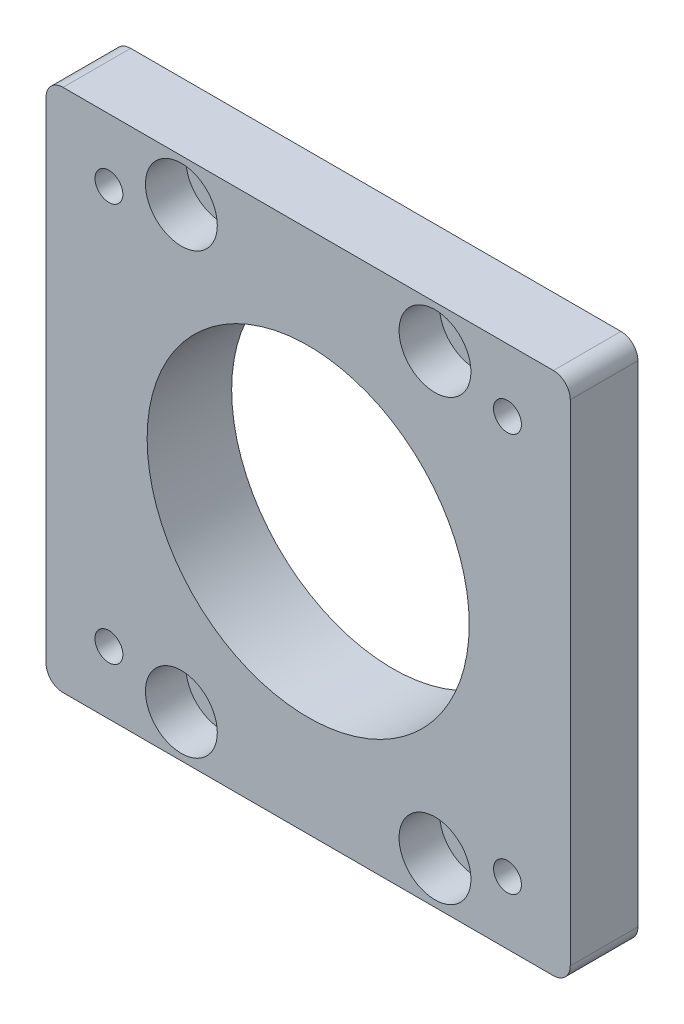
from build123d import *
from build123d.topology import SkipClean

# Parameters (mm, degrees)
SKETCH_1_W             = 62
SKETCH_1_H             = 62
SKETCH_1_R             = 19.05
EXTRUDE_1_DEPTH        = 8
SKETCH_2_R             = 1.25
CUT_EXTRUDE_1_DEPTH    = 45.56455991
SKETCH_5_R             = 2.25
CUT_EXTRUDE_3_DEPTH    = 45.56455991
SKETCH_6_R             = 4.25
CUT_EXTRUDE_4_DEPTH    = 4.8
FILLET_1_R             = 2
EXTRUDE_START          = 2
SKETCH_7_R             = 25
SKETCH_7_R_2           = 19.05
EXTRUDE_2_DEPTH        = 2
HOLE_WIZARD_M4_1_D     = 3.3
HOLE_WIZARD_M4_1_DEPTH = 13.4
HOLE_WIZARD_M4_1_TIP   = 0.991420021


with BuildPart() as part:
    # Sketch 1 → Extrude 1 (new body)
    with BuildSketch(Plane.XY):
        Rectangle(SKETCH_1_W, SKETCH_1_H)
        Circle(SKETCH_1_R, mode=Mode.SUBTRACT)
    extrude(amount=EXTRUDE_1_DEPTH)

    # Sketch 2 → Cut-Extrude 1 (cut, through all)
    with BuildSketch(Plane.XY.offset(8)):
        with Locations((-23.571404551, 23.571404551)):
            Circle(SKETCH_2_R)
        with Locations((23.571404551, 23.571404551)):
            Circle(SKETCH_2_R)
        with Locations((23.571404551, -23.571404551)):
            Circle(SKETCH_2_R)
        with Locations((-23.571404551, -23.571404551)):
            Circle(SKETCH_2_R)
    extrude(amount=-CUT_EXTRUDE_1_DEPTH, mode=Mode.SUBTRACT)

    # Sketch 5 → Cut-Extrude 3 (cut, through all)
    with BuildSketch(Plane.XY.offset(8)):
        with Locations((-15, 25.980762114)):
            Circle(SKETCH_5_R)
        with Locations((15, 25.980762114)):
            Circle(SKETCH_5_R)
        with Locations((15, -25.980762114)):
            Circle(SKETCH_5_R)
        with Locations((-15, -25.980762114)):
            Circle(SKETCH_5_R)
    extrude(amount=-CUT_EXTRUDE_3_DEPTH, mode=Mode.SUBTRACT)

    # Sketch 6 → Cut-Extrude 4 (cut)
    with BuildSketch(Plane.XY.offset(8)):
        with Locations((-15, 25.980762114)):
            Circle(SKETCH_6_R)
        with Locations((15, 25.980762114)):
            Circle(SKETCH_6_R)
        with Locations((15, -25.980762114)):
            Circle(SKETCH_6_R)
        with Locations((-15, -25.980762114)):
            Circle(SKETCH_6_R)
    extrude(amount=-CUT_EXTRUDE_4_DEPTH, mode=Mode.SUBTRACT)

    # Fillet 1
    fillet_1_edges = [part.edges().sort_by_distance(p)[0] for p in [
        (31, -31, 4),
        (-31, -31, 4),
        (-31, 31, 4),
        (31, 31, 4),
    ]]
    fillet(fillet_1_edges, radius=FILLET_1_R)

    # Sketch 7 → Extrude 2 (add)
    with SkipClean():  # the faces are left unmerged after this step: merging them gives an invalid solid
        with BuildSketch(Plane(origin=(0, 0, 0), x_dir=(-1, 0, 0), z_dir=(0, 0, -1)).offset(EXTRUDE_START)):
            Circle(SKETCH_7_R)
            Circle(SKETCH_7_R_2, mode=Mode.SUBTRACT)
        extrude(amount=-EXTRUDE_2_DEPTH)

    # Hole Wizard M4 _1
    with Locations(Plane.XY.offset(8)):
        with Locations((-23.571404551, 23.571404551), (-23.571404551, -23.571404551), (23.571404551, -23.571404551), (23.571404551, 23.571404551)):
            Hole(HOLE_WIZARD_M4_1_D / 2, depth=HOLE_WIZARD_M4_1_DEPTH)
            with Locations((0, 0, -(HOLE_WIZARD_M4_1_DEPTH + HOLE_WIZARD_M4_1_TIP / 2))):  # 118° drill point
                Cone(0, HOLE_WIZARD_M4_1_D / 2, HOLE_WIZARD_M4_1_TIP, mode=Mode.SUBTRACT)


solid = part.part
